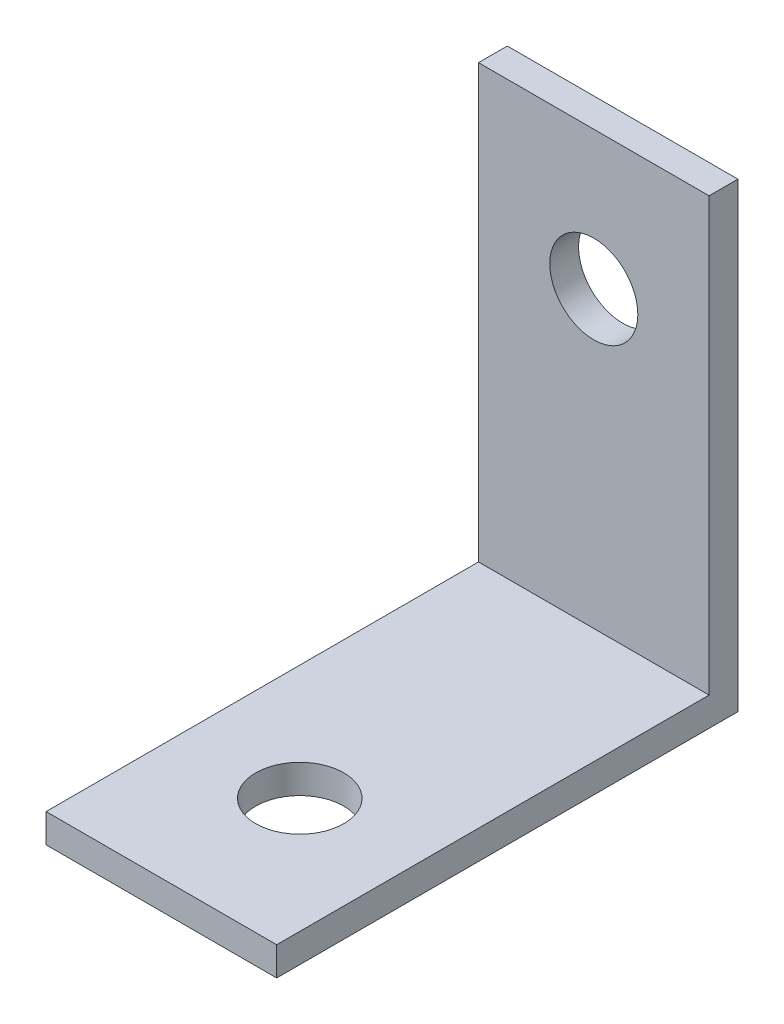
from build123d import *

# Parameters (mm, degrees)
BOSS_EXTRUDE1_DEPTH = 6.35
SKETCH2_R           = 2.4257
CUT_EXTRUDE1_DEPTH  = 36.390926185


with BuildPart() as part:
    # Sketch1 → Boss-Extrude1 (new, symmetric)
    with BuildSketch(Plane.YZ):
        Polygon((0, 0), (25.4, 0), (25.4, 1.5875), (1.5875, 1.5875), (1.5875, 25.4), (0, 25.4), align=None)
    extrude(amount=BOSS_EXTRUDE1_DEPTH, both=True)

    # Sketch2 → Cut-Extrude1 (cut, symmetric)
    with BuildSketch(Plane.XY.offset(1.5875)):
        with Locations((0, 17.78)):
            Circle(SKETCH2_R)
    cut_extrude1 = extrude(amount=CUT_EXTRUDE1_DEPTH, both=True, mode=Mode.SUBTRACT)

    # Mirror1: Cut-Extrude1 across plane
    add(cut_extrude1.mirror(Plane(origin=(0, 0, 0), x_dir=(0, 0.7071067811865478, 0.7071067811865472), z_dir=(0, -0.7071067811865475, 0.7071067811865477))), mode=Mode.SUBTRACT)


solid = part.part
